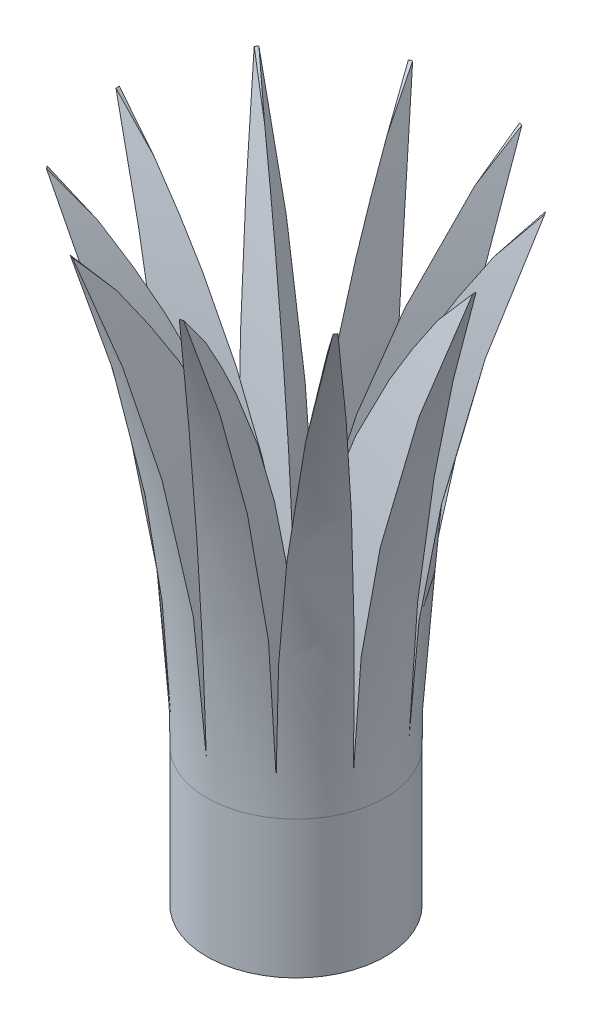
from build123d import *

# Parameters (mm, degrees)
ENL_V_MAT_EXTRU_1_DEPTH      = 38.749172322
R_P_TITION_CIRCULAIRE1_COUNT = 10
CHANFREIN1_SIZE              = 0.5
CHANFREIN1_SIZE2             = 0.288675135


with BuildPart() as part:
    # Esquisse1 → R_volution1 (revolve)
    with BuildSketch(Plane.XY, mode=Mode.PRIVATE) as r_volution1_sk:
        with BuildLine():
            Line((0, 0), (5, 0))
            Line((5, 0), (5, 8))
            ThreePointArc((5, 8), (6.260536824, 21.729530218), (10, 35))
            ThreePointArc((10, 35), (2.592719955, 23.462912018), (0, 10))
            Line((0, 10), (0, 0))
        make_face()
    revolve(r_volution1_sk.sketch.rotate(Axis((0, 10, 0), (0, -1, 0)), 180), axis=Axis((0, 10, 0), (0, -1, 0)))

    # Esquisse2 → Enl_v. mat.-Extru.1 (cut, through all)
    with BuildSketch(Plane.XY):
        with BuildLine():
            Line((-3, 35), (3, 35))
            ThreePointArc((3, 35), (0.752680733, 22.589678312), (0, 10))
            ThreePointArc((0, 10), (-0.752680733, 22.589678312), (-3, 35))
        make_face()
    enl_v_mat_extru_1 = extrude(amount=-ENL_V_MAT_EXTRU_1_DEPTH, mode=Mode.SUBTRACT)

    # R_p_tition circulaire1: Enl_v. mat.-Extru.1 ×10 about axis
    r_p_tition_circulaire1_axis = Axis((0, 0, 0), (0, 1, 0))
    for i in range(1, R_P_TITION_CIRCULAIRE1_COUNT):
        add(enl_v_mat_extru_1.rotate(r_p_tition_circulaire1_axis, i * 360 / R_P_TITION_CIRCULAIRE1_COUNT), mode=Mode.SUBTRACT)

    # Chanfrein1
    chanfrein1_edges = [part.edges().sort_by_distance(p)[0] for p in [
        (5, 0, 0),
    ]]
    chanfrein1_side = [part.faces().sort_by_distance(p)[0] for p in [
        (0, 0, 0),
    ]]
    chamfer(chanfrein1_edges, length=CHANFREIN1_SIZE, length2=CHANFREIN1_SIZE2, reference=chanfrein1_side[0])


solid = part.part
